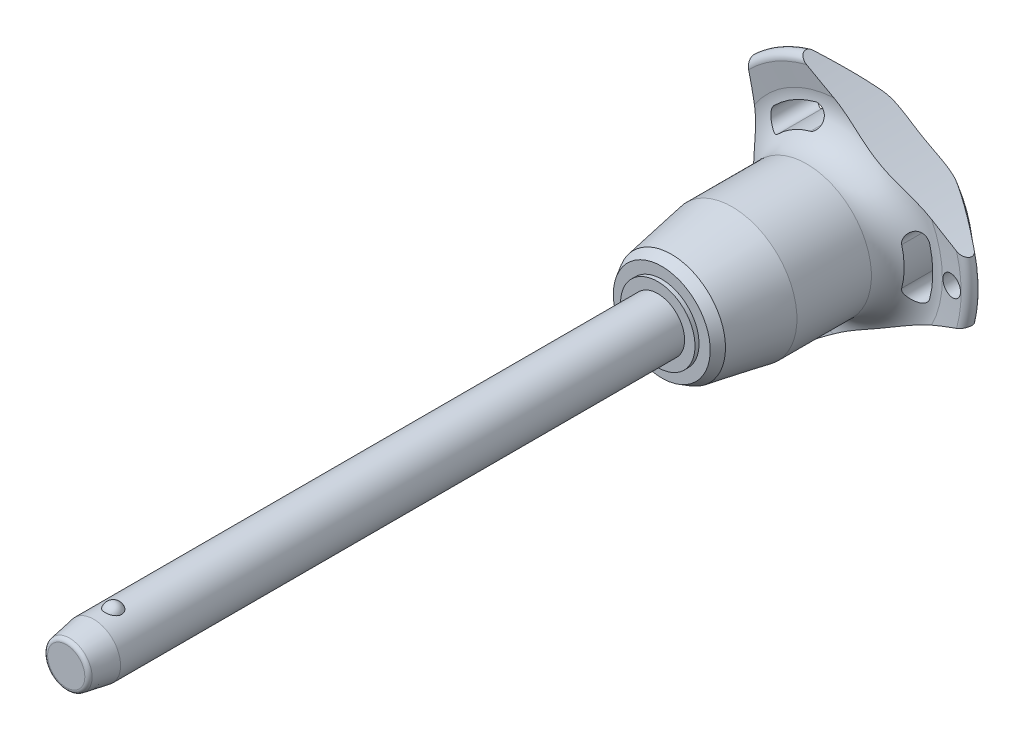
from build123d import *

# Parameters (mm, degrees)
SKETCH1_R           = 4
BOSS_EXTRUDE1_DEPTH = 80
SKETCH2_R           = 3.4
BOSS_EXTRUDE2_DEPTH = 33.3
BOSS_EXTRUDE3_START = 8.2
SKETCH1_2_R         = 4
BOSS_EXTRUDE3_DEPTH = 8.2
CHAMFER1_SIZE       = 4.1
CHAMFER1_SIZE2      = 0.722940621
FILLET1_R           = 0.6
SKETCH6_R           = 102.8
CUT_EXTRUDE1_DEPTH  = 117.644873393
CIRPATTERN1_COUNT   = 3
SKETCH7_R           = 1.5
CUT_EXTRUDE2_DEPTH  = 117.506132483


with BuildPart() as part:
    # Sketch1 → Boss-Extrude1 (new body)
    with BuildSketch(Plane.XY):
        Circle(SKETCH1_R)
    extrude(amount=-BOSS_EXTRUDE1_DEPTH)

    # Sketch2 → Boss-Extrude2 (add)
    with BuildSketch(Plane(origin=(0, 0, -80), x_dir=(-1, 0, 0), z_dir=(0, 0, -1))):
        Circle(SKETCH2_R)
    extrude(amount=BOSS_EXTRUDE2_DEPTH)

    # Sketch3 → Revolve1 (revolve)
    with BuildSketch(Plane(origin=(0, 0, 0), x_dir=(0, 0, -1), z_dir=(1, 0, 0))):
        with BuildLine():
            Line((-1.2, 4.8), (-1.2, 2.2))
            ThreePointArc((-1.2, 2.2), (0.1, 3.5), (-1.2, 4.8))
        make_face()
        with BuildLine():
            Line((-1.2, -2.2), (-1.2, -4.8))
            ThreePointArc((-1.2, -4.8), (0.1, -3.5), (-1.2, -2.2))
        make_face()
    revolve(axis=Axis((0, -2.2, 1.2), (0, 1, 0)))

    # Sketch1_2 → Boss-Extrude3 (add)
    with BuildSketch(Plane.XY.offset(BOSS_EXTRUDE3_START)):
        Circle(SKETCH1_2_R)
    extrude(amount=-BOSS_EXTRUDE3_DEPTH)

    # Chamfer1
    chamfer1_edges = [part.edges().sort_by_distance(p)[0] for p in [
        (-4, 0, 8.2),
    ]]
    chamfer1_side = [part.faces().sort_by_distance(p)[0] for p in [
        (-4, 0, -35.9),
    ]]
    chamfer(chamfer1_edges, length=CHAMFER1_SIZE, length2=CHAMFER1_SIZE2, reference=chamfer1_side[0])

    # Fillet1
    fillet1_edges = [part.edges().sort_by_distance(p)[0] for p in [
        (-3.277059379, 0, 8.2),
        (3.4, 0, -113.3),
    ]]
    fillet(fillet1_edges, radius=FILLET1_R)

    # Sketch4 → Revolve2 (revolve)
    with BuildSketch(Plane(origin=(0, 0, 0), x_dir=(0, 0, -1), z_dir=(1, 0, 0)), mode=Mode.PRIVATE) as revolve2_sk:
        Polygon((80, 0), (80, 5.554101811), (80.6, 5.554101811), (80.6, 7.220004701), (82.042714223, 8.052956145), (91.1, 9.65), (102.2, 9.65), (102.2, 0), align=None)
    revolve(revolve2_sk.sketch.rotate(Axis((0, 0, -102.2), (0, 0, 1)), 90), axis=Axis((0, 0, -102.2), (0, 0, 1)))

    # Sketch5 → Revolve3 (revolve)
    with BuildSketch(Plane(origin=(0, 0, 0), x_dir=(0, 0, -1), z_dir=(1, 0, 0)), mode=Mode.PRIVATE) as revolve3_sk:
        with BuildLine():
            Line((107.16082631, 15.274661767), (106.757834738, 18.475067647))
            ThreePointArc((106.757834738, 18.475067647), (107.349836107, 19.516443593), (108.516044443, 19.24278761))
            Line((108.516044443, 19.24278761), (112.835691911, 14.094832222))
            ThreePointArc((112.835691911, 14.094832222), (113.3, 12.689260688), (112.67067517, 11.349423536))
            ThreePointArc((112.67067517, 11.349423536), (109.033110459, 6.185112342), (107.75, 0))
            Line((107.75, 0), (102.2, 0))
            Line((102.2, 0), (102.2, 9.65))
            ThreePointArc((102.2, 9.65), (105.949887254, 11.342683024), (107.16082631, 15.274661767))
        make_face()
    revolve(revolve3_sk.sketch.rotate(Axis((0, 0, -107.75), (0, 0, 1)), 90), axis=Axis((0, 0, -107.75), (0, 0, 1)))

    # Sketch6 → Cut-Extrude1 (cut, through all)
    with BuildSketch(Plane.XY):
        with Locations((-115.2, 0)):
            Circle(SKETCH6_R)
        with BuildLine():
            ThreePointArc((13.411913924, -3.529271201), (13.868496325, 0), (13.411913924, 3.529271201))
            ThreePointArc((13.411913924, 3.529271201), (11.694200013, 4.531299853), (10.692171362, 2.813585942))
            ThreePointArc((10.692171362, 2.813585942), (11.056165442, 0), (10.692171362, -2.813585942))
            ThreePointArc((10.692171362, -2.813585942), (11.694200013, -4.531299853), (13.411913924, -3.529271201))
        make_face()
    cut_extrude1 = extrude(amount=-CUT_EXTRUDE1_DEPTH, mode=Mode.SUBTRACT)

    # CirPattern1: Cut-Extrude1 ×3 about axis
    cirpattern1_axis = Axis((0, 0, 0), (0, 0, 1))
    for i in range(1, CIRPATTERN1_COUNT):
        add(cut_extrude1.rotate(cirpattern1_axis, i * 360 / CIRPATTERN1_COUNT), mode=Mode.SUBTRACT)

    # Sketch7 → Cut-Extrude2 (cut, through all)
    with BuildSketch(Plane.XY):
        with Locations(Location((16.868496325, 0, 0), (0, 0, 225.467095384))):
            Circle(SKETCH7_R)
    extrude(amount=-CUT_EXTRUDE2_DEPTH, mode=Mode.SUBTRACT)


solid = part.part
